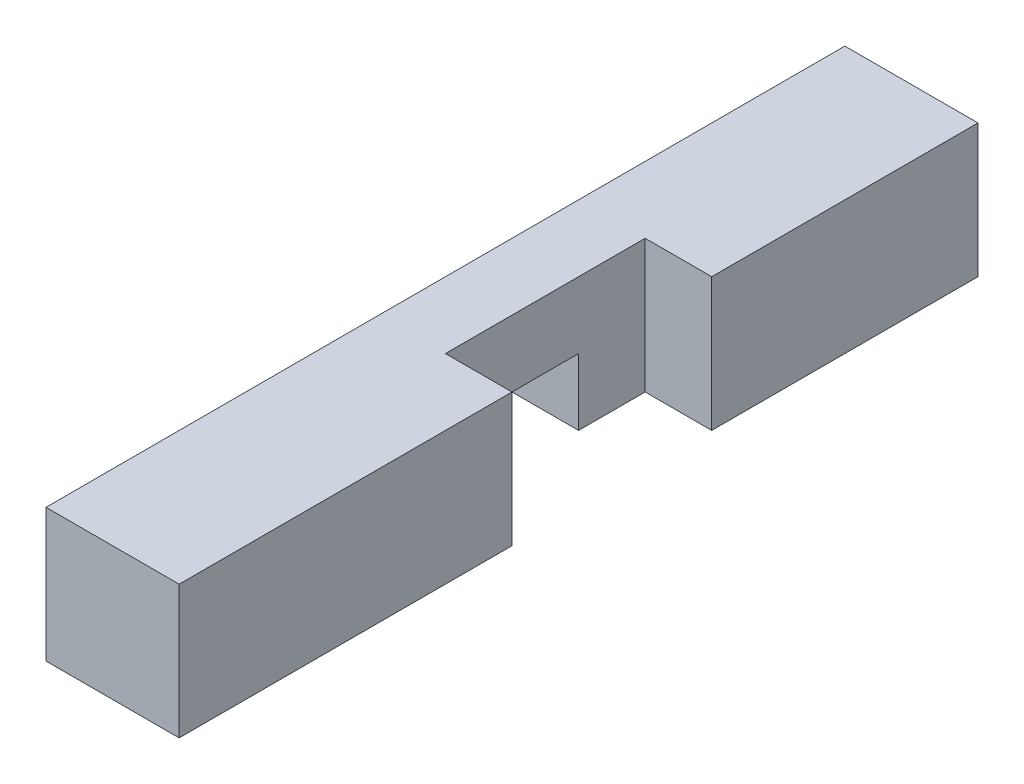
from build123d import *

# Parameters (mm, degrees)
SKETCH1_W      = 20
SKETCH1_H      = 20
EXTRUDE1_DEPTH = 120
SKETCH2_W      = 10
SKETCH2_H      = 30
EXTRUDE2_DEPTH = 124.288280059
SKETCH3_W      = 20
SKETCH3_H      = 10
EXTRUDE3_DEPTH = 123.065556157


with BuildPart() as part:
    # Sketch1 → Extrude1 (new body)
    with BuildSketch(Plane.XY):
        with Locations((10, 10)):
            Rectangle(SKETCH1_W, SKETCH1_H)
    extrude(amount=EXTRUDE1_DEPTH)

    # Sketch2 → Extrude2 (cut, through all)
    with BuildSketch(Plane(origin=(0, 20, 0), x_dir=(1, 0, 0), z_dir=(0, 1, 0))):
        with Locations((15, -55)):
            Rectangle(SKETCH2_W, SKETCH2_H)
    extrude(amount=-EXTRUDE2_DEPTH, mode=Mode.SUBTRACT)

    # Sketch3 → Extrude3 (cut, through all)
    with BuildSketch(Plane(origin=(10, 0, 0), x_dir=(0, 0, -1), z_dir=(1, 0, 0))):
        with Locations((-60, 5)):
            Rectangle(SKETCH3_W, SKETCH3_H)
    extrude(amount=-EXTRUDE3_DEPTH, mode=Mode.SUBTRACT)


solid = part.part
